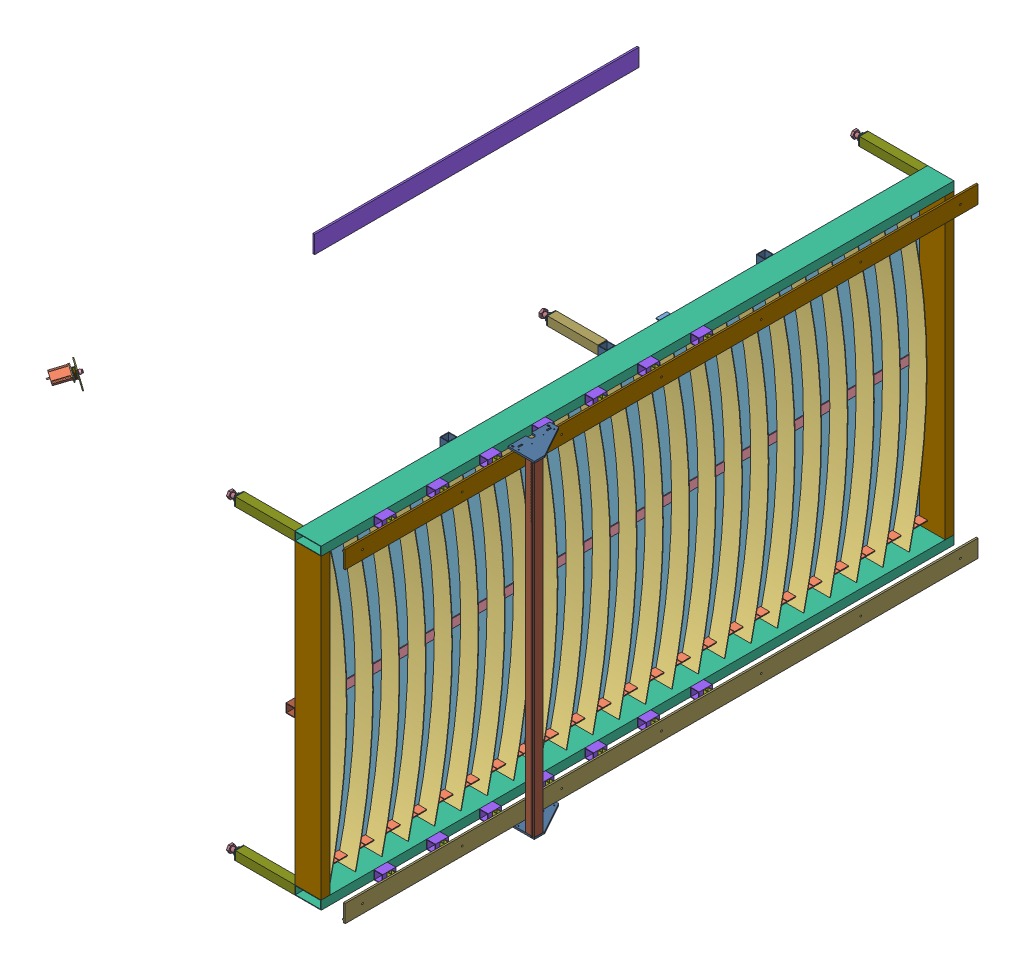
SolidWorks assembly Whole Torch Table.SLDASM, configuration Default (file format 4400). Lengths in mm.
Overall size (2743 3043.23 3684.66).
143 component instances, 30 part files, 19 mates.
Components (placement in the parent):
- waterbed-1: waterbed.SLDASM [Default] at (-189.3965 265.9608 -1112.5018) size (808.94 1728.67 3556)
  - central rib slats-1: central rib slats.SLDPRT [Default] at (-19.9608 -0.7672 -0.6907) size (50.8 4.76 63.5)
  - rib angle-1: rib angle.SLDPRT [Default] at (660.0296 579.5703 -775.8506) size (50.8 50.8 3550.92)
  - rib curved-1: rib curved.SLDPRT [Default] at (664.7921 633.5453 -613.9662) x (0 -1 0) z (0 0 1) size (1728.67 101.6 104.77)
  - rib flatbar-1: rib flatbar.SLDPRT [Default] at (635.383 -249.0699 -780.9306) x (0 -1 0) z (0 0 1) size (50.8 4.76 3403.6)
  - waterbed-1: waterbed.SLDPRT [Default] at (656.8546 597.5082 2723.2088) x (1 0 0) z (0 1 0) size (3.17 3556 1720.85)
  - rib angle-2: rib angle.SLDPRT [Default] at (660.0296 -1039.6797 2774.085) x (1 0 0) z (0 0 -1) size (50.8 50.8 3550.92)
  - rib curved-2: rib curved.SLDPRT [Default] at (664.7921 633.5453 -461.5662) x (0 -1 0) z (0 0 1) size (1728.67 101.6 104.77)
  - rib curved-3: rib curved.SLDPRT [Default] at (664.7921 633.5453 -309.1662) x (0 -1 0) z (0 0 1) size (1728.67 101.6 104.77)
  - rib curved-4: rib curved.SLDPRT [Default] at (664.7921 633.5453 -156.7662) x (0 -1 0) z (0 0 1) size (1728.67 101.6 104.77)
  - rib curved-5: rib curved.SLDPRT [Default] at (664.7921 633.5453 -4.3662) x (0 -1 0) z (0 0 1) size (1728.67 101.6 104.77)
  - rib curved-6: rib curved.SLDPRT [Default] at (664.7921 633.5453 148.0338) x (0 -1 0) z (0 0 1) size (1728.67 101.6 104.77)
  - rib curved-7: rib curved.SLDPRT [Default] at (664.7921 633.5453 300.4338) x (0 -1 0) z (0 0 1) size (1728.67 101.6 104.77)
  - rib curved-8: rib curved.SLDPRT [Default] at (664.7921 633.5453 452.8338) x (0 -1 0) z (0 0 1) size (1728.67 101.6 104.77)
  - rib curved-9: rib curved.SLDPRT [Default] at (664.7921 633.5453 605.2338) x (0 -1 0) z (0 0 1) size (1728.67 101.6 104.77)
  - rib curved-10: rib curved.SLDPRT [Default] at (664.7921 633.5453 757.6338) x (0 -1 0) z (0 0 1) size (1728.67 101.6 104.77)
  - rib curved-11: rib curved.SLDPRT [Default] at (664.7921 633.5453 910.0338) x (0 -1 0) z (0 0 1) size (1728.67 101.6 104.77)
  - rib curved-12: rib curved.SLDPRT [Default] at (664.7921 633.5453 1062.4338) x (0 -1 0) z (0 0 1) size (1728.67 101.6 104.77)
  - rib curved-13: rib curved.SLDPRT [Default] at (664.7921 633.5453 1214.8338) x (0 -1 0) z (0 0 1) size (1728.67 101.6 104.77)
  - rib curved-14: rib curved.SLDPRT [Default] at (664.7921 633.5453 1367.2338) x (0 -1 0) z (0 0 1) size (1728.67 101.6 104.77)
  - rib curved-15: rib curved.SLDPRT [Default] at (664.7921 633.5453 1519.6338) x (0 -1 0) z (0 0 1) size (1728.67 101.6 104.77)
  - rib curved-16: rib curved.SLDPRT [Default] at (664.7921 633.5453 1672.0338) x (0 -1 0) z (0 0 1) size (1728.67 101.6 104.77)
  - rib curved-17: rib curved.SLDPRT [Default] at (664.7921 633.5453 1824.4338) x (0 -1 0) z (0 0 1) size (1728.67 101.6 104.77)
  - rib curved-18: rib curved.SLDPRT [Default] at (664.7921 633.5453 1976.8338) x (0 -1 0) z (0 0 1) size (1728.67 101.6 104.77)
  - rib curved-19: rib curved.SLDPRT [Default] at (664.7921 633.5453 2129.2338) x (0 -1 0) z (0 0 1) size (1728.67 101.6 104.77)
  - rib curved-20: rib curved.SLDPRT [Default] at (664.7921 633.5453 2281.6338) x (0 -1 0) z (0 0 1) size (1728.67 101.6 104.77)
  - rib curved-21: rib curved.SLDPRT [Default] at (664.7921 633.5453 2434.0338) x (0 -1 0) z (0 0 1) size (1728.67 101.6 104.77)
  - rib curved-22: rib curved.SLDPRT [Default] at (664.7921 633.5453 2586.4338) x (0 -1 0) z (0 0 1) size (1728.67 101.6 104.77)
  - rib curved-23: rib curved.SLDPRT [Default] at (664.7921 633.5453 2738.8338) x (0 -1 0) z (0 0 1) size (1728.67 101.6 104.77)
- frame-1: frame.SLDASM [Default] at (-471.7236 1115.2073 -1217.4748) x (0 -1 0) z (0 0 1) size (1822.45 304.8 3657.6)
  - 2x6 tube short-1: 2x6 tube short.SLDPRT [Default] at (168.0761 939.1817 -726.7576) size (50.8 152.4 3657.6)
  - 2x6 tube short-2: 2x6 tube short.SLDPRT [Default] at (1939.7261 939.1817 -726.7576) size (50.8 152.4 3657.6)
  - gantry spacers-1: gantry spacers.SLDPRT [Default] at (168.0761 1167.7817 2587.9424) x (0 1 0) z (1 0 0) size (50.8 25.4 50.8)
  - gantry spacers 2-1: gantry spacers 2.SLDPRT [Default] at (191.6386 1052.0541 2626.0424) x (0 1 0) z (-1 0 0) size (50.8 76.2 50.8)
  - tube-1: tube.SLDPRT [Default] at (1939.7261 1091.5817 2930.8424) x (0 0 -1) z (-1 0 0) size (50.8 152.4 1720.85)
  - tube 2-1: tube 2.SLDPRT [Default] at (190.3011 913.7817 1102.0424) x (0 0 -1) z (1 0 0) size (50.8 50.8 885.83)
  - tube-2: tube.SLDPRT [Default] at (1939.7261 1091.5817 -675.9576) x (0 0 -1) z (-1 0 0) size (50.8 152.4 1720.85)
  - tube 3-1: tube 3.SLDPRT [Default] at (1079.3011 913.7817 -726.7576) size (50.8 50.8 3657.6)
  - tube 2-2: tube 2.SLDPRT [Default] at (190.3011 913.7817 187.6424) x (0 0 -1) z (1 0 0) size (50.8 50.8 885.83)
  - tube 2-3: tube 2.SLDPRT [Default] at (190.3011 913.7817 2016.4424) x (0 0 -1) z (1 0 0) size (50.8 50.8 885.83)
  - tube 2-4: tube 2.SLDPRT [Default] at (190.3011 913.7817 1102.0424) x (0 0 -1) z (1 0 0) size (50.8 50.8 885.83)
  - tube 2-5: tube 2.SLDPRT [Default] at (1126.9261 913.7817 2016.4424) x (0 0 -1) z (1 0 0) size (50.8 50.8 885.83)
  - tube 2-6: tube 2.SLDPRT [Default] at (1126.9261 913.7817 1102.0424) x (0 0 -1) z (1 0 0) size (50.8 50.8 885.83)
  - tube 2-7: tube 2.SLDPRT [Default] at (1126.9261 913.7817 187.6424) x (0 0 -1) z (1 0 0) size (50.8 50.8 885.83)
  - gantry spacers-2: gantry spacers.SLDPRT [Default] at (168.0761 1167.7817 2283.1424) x (0 1 0) z (1 0 0) size (50.8 25.4 50.8)
  - gantry spacers-3: gantry spacers.SLDPRT [Default] at (168.0761 1167.7817 1978.3424) x (0 1 0) z (1 0 0) size (50.8 25.4 50.8)
  - gantry spacers-4: gantry spacers.SLDPRT [Default] at (168.0761 1167.7817 1673.5424) x (0 1 0) z (1 0 0) size (50.8 25.4 50.8)
  - gantry spacers-5: gantry spacers.SLDPRT [Default] at (168.0761 1167.7817 1368.7424) x (0 1 0) z (1 0 0) size (50.8 25.4 50.8)
  - gantry spacers-6: gantry spacers.SLDPRT [Default] at (168.0761 1167.7817 1063.9424) x (0 1 0) z (1 0 0) size (50.8 25.4 50.8)
  - gantry spacers-7: gantry spacers.SLDPRT [Default] at (168.0761 1167.7817 759.1424) x (0 1 0) z (1 0 0) size (50.8 25.4 50.8)
  - gantry spacers 2-2: gantry spacers 2.SLDPRT [Default] at (191.6386 1052.0541 2321.2424) x (0 1 0) z (-1 0 0) size (50.8 76.2 50.8)
  - gantry spacers 2-3: gantry spacers 2.SLDPRT [Default] at (191.6386 1052.0541 2016.4424) x (0 1 0) z (-1 0 0) size (50.8 76.2 50.8)
  - gantry spacers 2-4: gantry spacers 2.SLDPRT [Default] at (191.6386 1052.0541 1711.6424) x (0 1 0) z (-1 0 0) size (50.8 76.2 50.8)
  - gantry spacers 2-5: gantry spacers 2.SLDPRT [Default] at (191.6386 1052.0541 1406.8424) x (0 1 0) z (-1 0 0) size (50.8 76.2 50.8)
  - gantry spacers 2-6: gantry spacers 2.SLDPRT [Default] at (191.6386 1052.0541 1102.0424) x (0 1 0) z (-1 0 0) size (50.8 76.2 50.8)
  - gantry spacers 2-7: gantry spacers 2.SLDPRT [Default] at (191.6386 1052.0541 797.2424) x (0 1 0) z (-1 0 0) size (50.8 76.2 50.8)
  - gantry spacers-15: gantry spacers.SLDPRT [Default] at (1990.5261 1167.7817 2587.9424) x (0 1 0) z (-1 0 0) size (50.8 25.4 50.8)
  - gantry spacers 2-15: gantry spacers 2.SLDPRT [Default] at (1963.2886 1052.0541 2626.0424) x (0 1 0) z (-1 0 0) size (50.8 76.2 50.8)
  - gantry spacers-16: gantry spacers.SLDPRT [Default] at (1990.5261 1167.7817 2283.1424) x (0 1 0) z (-1 0 0) size (50.8 25.4 50.8)
  - gantry spacers-17: gantry spacers.SLDPRT [Default] at (1990.5261 1167.7817 1978.3424) x (0 1 0) z (-1 0 0) size (50.8 25.4 50.8)
  - gantry spacers-18: gantry spacers.SLDPRT [Default] at (1990.5261 1167.7817 1673.5424) x (0 1 0) z (-1 0 0) size (50.8 25.4 50.8)
  - gantry spacers-19: gantry spacers.SLDPRT [Default] at (1990.5261 1167.7817 1368.7424) x (0 1 0) z (-1 0 0) size (50.8 25.4 50.8)
  - gantry spacers-20: gantry spacers.SLDPRT [Default] at (1990.5261 1167.7817 1063.9424) x (0 1 0) z (-1 0 0) size (50.8 25.4 50.8)
  - gantry spacers-21: gantry spacers.SLDPRT [Default] at (1990.5261 1167.7817 759.1424) x (0 1 0) z (-1 0 0) size (50.8 25.4 50.8)
  - gantry spacers 2-16: gantry spacers 2.SLDPRT [Default] at (1963.2886 1052.0541 2321.2424) x (0 1 0) z (-1 0 0) size (50.8 76.2 50.8)
  - gantry spacers 2-17: gantry spacers 2.SLDPRT [Default] at (1963.2886 1052.0541 2016.4424) x (0 1 0) z (-1 0 0) size (50.8 76.2 50.8)
  - gantry spacers 2-18: gantry spacers 2.SLDPRT [Default] at (1963.2886 1052.0541 1711.6424) x (0 1 0) z (-1 0 0) size (50.8 76.2 50.8)
  - gantry spacers 2-19: gantry spacers 2.SLDPRT [Default] at (1963.2886 1052.0541 1406.8424) x (0 1 0) z (-1 0 0) size (50.8 76.2 50.8)
  - gantry spacers 2-20: gantry spacers 2.SLDPRT [Default] at (1963.2886 1052.0541 1102.0424) x (0 1 0) z (-1 0 0) size (50.8 76.2 50.8)
  - gantry spacers 2-21: gantry spacers 2.SLDPRT [Default] at (1963.2886 1052.0541 797.2424) x (0 1 0) z (-1 0 0) size (50.8 76.2 50.8)
- short leg-1: short leg.SLDASM [Default] at (270.298 137.9726 -194.9021) x (0 1 0) z (0 0 1) size (50.8 347.66 50.8)
  - short leg-1: short leg.SLDPRT [Default] at (-102.0664 -0.3101 54.0697) size (50.8 292.1 50.8)
  - bolt-1: bolt.SLDPRT [Default] at (-102.0664 201.3024 79.4697) x (-1 0 0) z (0 -1 0) size (44.45 38.49 169.67)
  - leg cap-1: leg cap.SLDPRT [Default] at (-102.0664 150.5024 79.4697) x (-1 0 0) z (0 0 1) size (50.8 4.76 50.8)
  - nut-1: nut.SLDPRT [Default] at (-102.0664 150.5024 79.4697) x (-1 0 0) z (0 1 0) size (44.45 38.49 12.7)
- long leg-1: long leg.SLDASM [Default] at (88.2851 -885.4902 1678.7251) x (0 0 -1) z (1 0 0) size (50.8 50.8 398.46)
  - bolt-1: bolt.SLDPRT [Default] at (-9.2425 35.5714 -19.2895) size (44.45 38.49 169.67)
  - leg cap-1: leg cap.SLDPRT [Default] at (-9.2425 35.5714 36.273) x (1 0 0) z (0 1 0) size (50.8 4.76 50.8)
  - leg tube long-1: leg tube long.SLDPRT [Default] at (-9.2425 10.1714 207.723) x (1 0 0) z (0 1 0) size (50.8 342.9 50.8)
  - nut-1: nut.SLDPRT [Default] at (-9.2425 35.5714 18.8105) size (44.45 38.49 12.7)
- motor mount-1: motor mount.SLDASM [Default] at (-1920.191 165.7834 692.2862) size (140.97 147.27 197.03)
  - bearing-1: bearing.SLDPRT [Default] at (95.1047 -83.6634 11.1279) x (0.433753 -0.900004 0.043029) z (-0.703692 -0.368194 -0.60766) size (24 7 24)
  - bearing-2: bearing.SLDPRT [Default] at (104.5236 -79.7587 -2.1454) x (-0.434443 0.899642 -0.043625) z (-0.703266 -0.369076 -0.607618) size (24 7 24)
  - belt features-1: belt features.SLDPRT [Default] at (102.8353 -80.4586 0.2337) x (0.452663 0.715759 0.531776) z (-0.56274 -0.233296 0.79303) size (96.71 53.39 10)
  - large ferris-1: large ferris.SLDPRT [Default] at (95.5197 -83.4914 10.5431) x (-0.563607 0.810076 -0.161629) z (-0.604707 -0.537913 -0.587349) size (57.15 14 57.15)
  - Motor-1: Motor.SLDPRT [Default] at (117.0374 -45.1999 45.2732) x (-0.56274 -0.233296 0.79303) z (0.452663 0.715759 0.531776) size (128.5 60 60)
  - Part1-1: Part1.SLDPRT [Default] at (106.8601 -64.4192 26.3919) x (0.452663 0.715759 0.531776) z (0.69168 -0.658227 0.297182) size (116.11 4.76 75.6)
  - pinion-1: pinion.SLDPRT [Default] at (109.1732 -77.8311 -8.6978) x (-0.467711 0.880882 -0.072751) z (-0.681594 -0.411849 -0.604822) size (22.23 18 22.23)
  - shaft-1: shaft.SLDPRT [Default] at (119.3025 -73.6317 -22.9724) x (0.433753 -0.900004 0.043029) z (-0.703692 -0.368194 -0.60766) size (9 50 9)
  - small ferris-1: small ferris.SLDPRT [Default] at (128.5735 -40.4174 29.0161) x (0.703889 -0.638257 0.31172) z (-0.56274 -0.233296 0.79303) size (31.75 31.75 17)
  - table side plate-1: table side plate.SLDPRT [Default] at (107.7664 -78.4143 -6.7152) x (-0.56274 -0.233296 0.79303) z (0.823746 -0.078144 0.561547) size (4.76 116.36 84.37)
- long leg-2: long leg.SLDASM [Default] at (88.2851 957.3025 1697.2101) x (0 0 1) z (1 0 0) size (50.8 50.8 398.46)
  - bolt-1: bolt.SLDPRT [Default] at (-9.2425 35.5714 -19.2895) size (44.45 38.49 169.67)
  - leg cap-1: leg cap.SLDPRT [Default] at (-9.2425 35.5714 36.273) x (1 0 0) z (0 1 0) size (50.8 4.76 50.8)
  - leg tube long-1: leg tube long.SLDPRT [Default] at (-9.2425 10.1714 207.723) x (1 0 0) z (0 1 0) size (50.8 342.9 50.8)
  - nut-1: nut.SLDPRT [Default] at (-9.2425 35.5714 18.8105) size (44.45 38.49 12.7)
- long leg-3: long leg.SLDASM [Default] at (88.2851 -885.4902 -1928.0749) x (0 0 -1) z (1 0 0) size (50.8 50.8 398.46)
  - bolt-1: bolt.SLDPRT [Default] at (-9.2425 35.5714 -19.2895) size (44.45 38.49 169.67)
  - leg cap-1: leg cap.SLDPRT [Default] at (-9.2425 35.5714 36.273) x (1 0 0) z (0 1 0) size (50.8 4.76 50.8)
  - leg tube long-1: leg tube long.SLDPRT [Default] at (-9.2425 10.1714 207.723) x (1 0 0) z (0 1 0) size (50.8 342.9 50.8)
  - nut-1: nut.SLDPRT [Default] at (-9.2425 35.5714 18.8105) size (44.45 38.49 12.7)
- long leg-4: long leg.SLDASM [Default] at (88.2851 957.3025 -1909.5899) x (0 0 1) z (1 0 0) size (50.8 50.8 398.46)
  - bolt-1: bolt.SLDPRT [Default] at (-9.2425 35.5714 -19.2895) size (44.45 38.49 169.67)
  - leg cap-1: leg cap.SLDPRT [Default] at (-9.2425 35.5714 36.273) x (1 0 0) z (0 1 0) size (50.8 4.76 50.8)
  - leg tube long-1: leg tube long.SLDPRT [Default] at (-9.2425 10.1714 207.723) x (1 0 0) z (0 1 0) size (50.8 342.9 50.8)
  - nut-1: nut.SLDPRT [Default] at (-9.2425 35.5714 18.8105) size (44.45 38.49 12.7)
- short leg-3: short leg.SLDASM [Default] at (270.298 1026.9726 -194.9021) x (0 1 0) z (0 0 1) size (50.8 347.66 50.8)
  - short leg-1: short leg.SLDPRT [Default] at (-102.0664 -0.3101 54.0697) size (50.8 292.1 50.8)
  - bolt-1: bolt.SLDPRT [Default] at (-102.0664 201.3024 79.4697) x (-1 0 0) z (0 -1 0) size (44.45 38.49 169.67)
  - leg cap-1: leg cap.SLDPRT [Default] at (-102.0664 150.5024 79.4697) x (-1 0 0) z (0 0 1) size (50.8 4.76 50.8)
  - nut-1: nut.SLDPRT [Default] at (-102.0664 150.5024 79.4697) x (-1 0 0) z (0 1 0) size (44.45 38.49 12.7)
- short leg-4: short leg.SLDASM [Default] at (270.298 -751.0274 -194.9021) x (0 1 0) z (0 0 1) size (50.8 347.66 50.8)
  - short leg-1: short leg.SLDPRT [Default] at (-102.0664 -0.3101 54.0697) size (50.8 292.1 50.8)
  - bolt-1: bolt.SLDPRT [Default] at (-102.0664 201.3024 79.4697) x (-1 0 0) z (0 -1 0) size (44.45 38.49 169.67)
  - leg cap-1: leg cap.SLDPRT [Default] at (-102.0664 150.5024 79.4697) x (-1 0 0) z (0 0 1) size (50.8 4.76 50.8)
  - nut-1: nut.SLDPRT [Default] at (-102.0664 150.5024 79.4697) x (-1 0 0) z (0 1 0) size (44.45 38.49 12.7)
- short leg-5: short leg.SLDASM [Default] at (270.298 137.9726 -194.9021) x (0 1 0) z (0 0 1) size (50.8 347.66 50.8)
  - short leg-1: short leg.SLDPRT [Default] at (-102.0664 -0.3101 54.0697) size (50.8 292.1 50.8)
  - bolt-1: bolt.SLDPRT [Default] at (-102.0664 201.3024 79.4697) x (-1 0 0) z (0 -1 0) size (44.45 38.49 169.67)
  - leg cap-1: leg cap.SLDPRT [Default] at (-102.0664 150.5024 79.4697) x (-1 0 0) z (0 0 1) size (50.8 4.76 50.8)
  - nut-1: nut.SLDPRT [Default] at (-102.0664 150.5024 79.4697) x (-1 0 0) z (0 1 0) size (44.45 38.49 12.7)
- short leg-6: short leg.SLDASM [Default] at (270.298 137.9726 -1109.3021) x (0 1 0) z (0 0 1) size (50.8 347.66 50.8)
  - short leg-1: short leg.SLDPRT [Default] at (-102.0664 -0.3101 54.0697) size (50.8 292.1 50.8)
  - bolt-1: bolt.SLDPRT [Default] at (-102.0664 201.3024 79.4697) x (-1 0 0) z (0 -1 0) size (44.45 38.49 169.67)
  - leg cap-1: leg cap.SLDPRT [Default] at (-102.0664 150.5024 79.4697) x (-1 0 0) z (0 0 1) size (50.8 4.76 50.8)
  - nut-1: nut.SLDPRT [Default] at (-102.0664 150.5024 79.4697) x (-1 0 0) z (0 1 0) size (44.45 38.49 12.7)
- short leg-7: short leg.SLDASM [Default] at (270.298 137.9726 719.4979) x (0 1 0) z (0 0 1) size (50.8 347.66 50.8)
  - short leg-1: short leg.SLDPRT [Default] at (-102.0664 -0.3101 54.0697) size (50.8 292.1 50.8)
  - bolt-1: bolt.SLDPRT [Default] at (-102.0664 201.3024 79.4697) x (-1 0 0) z (0 -1 0) size (44.45 38.49 169.67)
  - leg cap-1: leg cap.SLDPRT [Default] at (-102.0664 150.5024 79.4697) x (-1 0 0) z (0 0 1) size (50.8 4.76 50.8)
  - nut-1: nut.SLDPRT [Default] at (-102.0664 150.5024 79.4697) x (-1 0 0) z (0 1 0) size (44.45 38.49 12.7)
- short leg-8: short leg.SLDASM [Default] at (270.298 137.9726 -194.9021) x (0 1 0) z (0 0 1) size (50.8 347.66 50.8)
  - short leg-1: short leg.SLDPRT [Default] at (-102.0664 -0.3101 54.0697) size (50.8 292.1 50.8)
  - bolt-1: bolt.SLDPRT [Default] at (-102.0664 201.3024 79.4697) x (-1 0 0) z (0 -1 0) size (44.45 38.49 169.67)
  - leg cap-1: leg cap.SLDPRT [Default] at (-102.0664 150.5024 79.4697) x (-1 0 0) z (0 0 1) size (50.8 4.76 50.8)
  - nut-1: nut.SLDPRT [Default] at (-102.0664 150.5024 79.4697) x (-1 0 0) z (0 1 0) size (44.45 38.49 12.7)
- gantry-1: gantry.SLDASM [Default] at (185.9073 2187.6121 174.5318) x (0 0 -1) z (0 -1 0) size (3657.6 630.8 3043.23)
  - gantry flatbar-1: gantry flatbar.SLDPRT [Default] at (-245.5382 29.8392 105.8979) size (1873.25 10 101.6)
  - x axis-1: x axis.SLDPRT [Default] at (2145.8199 550.6945 1289.9197) x (0 0 -1) z (-1 0 0) size (101.6 15 3657.6)
  - y axis end brackets-1: y axis end brackets.SLDPRT [Default] at (-331.5015 532.8252 1205.0809) size (241.3 152.4 10)
  - y axis track-1: y axis track.SLDPRT [Default] at (-533.8801 609.8433 1215.0809) x (-1 0 0) z (0 1 0) size (55.8 1873.25 50.8)
  - y axis end brackets-2: y axis end brackets.SLDPRT [Default] at (-331.5015 532.8252 3088.3309) size (241.3 152.4 10)
  - Mirrorx axis-2: Mirrorx axis.SLDPRT [Default] at (2145.8199 550.6945 3013.4922) x (0 0 1) z (1 0 0) size (101.6 15 3657.6)
Mates (geometry in assembly coordinates):
- Coincident1: coincident anti-aligned: plane of waterbed-1/waterbed-1 through (467.4581 896.3312 -1893.4324) normal (-1 0 0); plane of frame-1/tube 3-1 through (467.4581 10.5062 -1944.2324) normal (1 0 0)
- Coincident2: coincident anti-aligned: plane of waterbed-1/waterbed-1 through (467.4581 896.3312 -1893.4324) normal (0 1 0); plane of frame-1/2x6 tube short-1 through (467.4581 896.3312 -1944.2324) normal (0 -1 0)
- Coincident3: coincident anti-aligned: plane of waterbed-1/waterbed-1 through (467.4581 -824.5188 -1893.4324) normal (0 0 -1); plane of frame-1/tube-2 through (467.4581 -824.5188 -1893.4324) normal (0 0 1)
- Coincident4: coincident anti-aligned: plane of frame-1/tube 3-1 through (416.6581 61.3062 -1944.2324) normal (-1 0 0); plane of ? through (416.6581 61.3062 -140.8324) normal (1 0 0)
- Coincident7: coincident anti-aligned: plane of frame-1/2x6 tube short-2 through (467.4581 -824.5188 -1944.2324) normal (-1 0 0); plane of long leg-1/leg tube long-1 through (467.4581 -875.3188 1662.5676) normal (1 0 0)
- Coincident8: coincident aligned: plane of frame-1/tube-1 through (467.4581 -824.5188 1713.3676) normal (0 0 1); plane of long leg-1/leg tube long-1 through (467.4581 -875.3188 1713.3676) normal (0 0 1)
- Coincident9: coincident aligned: plane of frame-1/2x6 tube short-2 through (467.4581 -875.3188 -1944.2324) normal (0 -1 0); plane of long leg-1/leg tube long-1 through (467.4581 -875.3188 1662.5676) normal (0 -1 0)
- Coincident10: coincident aligned: plane of frame-1/tube 3-1 through (416.6581 10.5062 -1944.2324) normal (0 -1 0); plane of ? through (416.6581 10.5062 -140.8324) normal (0 -1 0)
- Coincident11: coincident aligned: plane of frame-1/tube 2-6 through (416.6581 82.3482 -140.8324) normal (0 0 -1); plane of ? through (416.6581 61.3062 -140.8324) normal (0 0 -1)
- Coincident12: coincident anti-aligned: plane of frame-1/gantry spacers-20 through (721.4581 -875.3188 -140.8324) normal (1 0 0); plane of gantry-1/x axis-1 through (721.4581 870.9312 1686.3119) normal (-1 0 0)
- Parallel1: parallel anti-aligned: line of frame-1/2x6 tube short-2 through (619.8581 -875.3188 -1944.2324) axis (0 0 1); line of gantry-1/x axis-1 through (731.4581 972.5312 1686.3119) axis (0 0 -1)
- Coincident14: coincident: moEndPointRef_w of frame-1/tube-1; plane of assembly
- Coincident15: coincident: moEndPointRef_w of frame-1/tube-2; plane of assembly
- Coincident16: coincident: unknown of frame-1/tube 3-1
- PLANE1: unknown: unknown of frame-1/tube 3-1; unknown of frame-1/tube 3-1; unknown of frame-1/tube 3-1
- PLANE2: unknown: unknown of frame-1/tube 2-6; unknown of ?; unknown of ?
- LocalLPattern2: unknown: line of frame-1/tube 3-1 through (416.6581 61.3062 -1944.2324) axis (0 0 1); line of frame-1/tube 3-1 through (416.6581 10.5062 -1944.2324) axis (0 0 1)
- PLANE3: unknown: unknown of gantry-1/y axis track-1; unknown of gantry-1/y axis track-1; unknown of gantry-1/y axis track-1
- PLANE4: unknown: unknown of gantry-1/x axis-1; unknown of gantry-1/x axis-1; unknown of gantry-1/x axis-1
